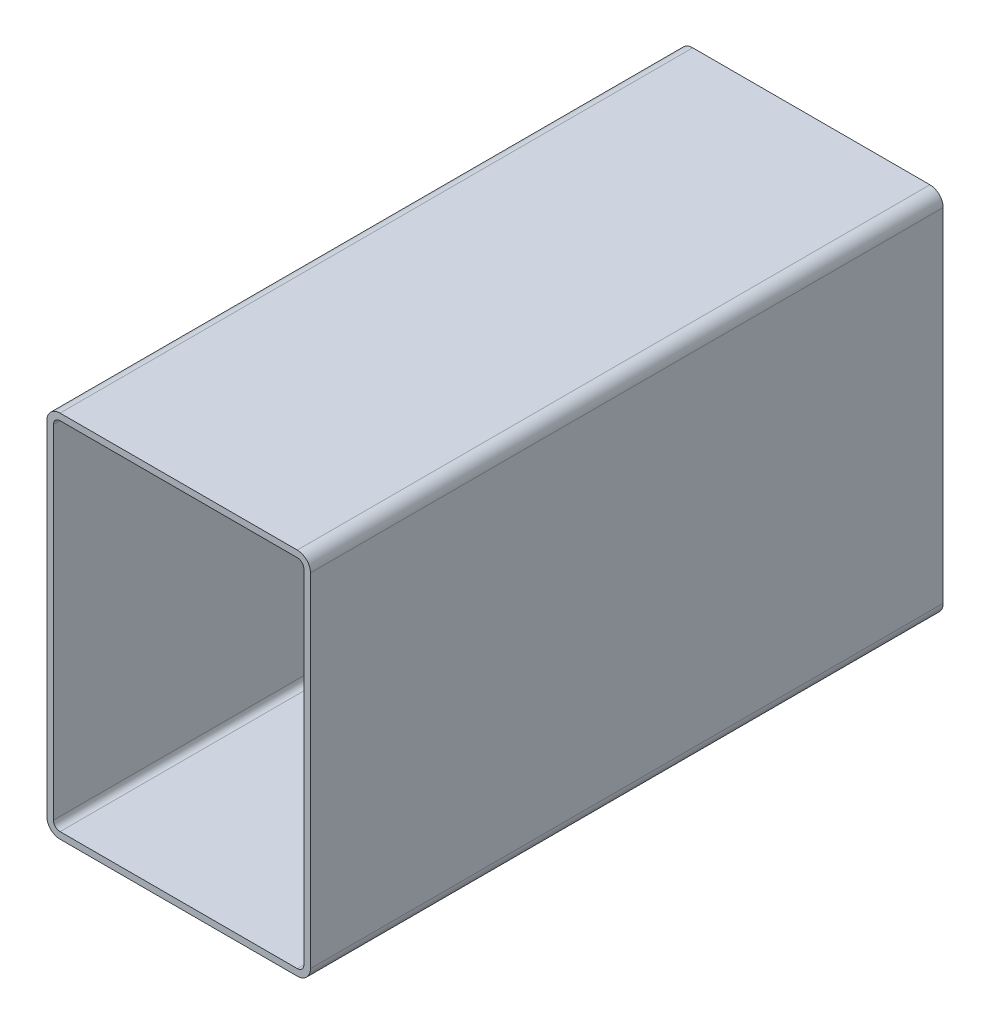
ISO-10303-21;
HEADER;
FILE_DESCRIPTION(('STEP AP214'),'2;1');
FILE_NAME('part.step','',(''),(''),'','','');
FILE_SCHEMA(('AUTOMOTIVE_DESIGN { 1 0 10303 214 1 1 1 1 }'));
ENDSEC;
DATA;
#1=APPLICATION_CONTEXT('core data for automotive mechanical design processes');
#2=APPLICATION_PROTOCOL_DEFINITION('international standard','automotive_design',2000,#1);
#3=PRODUCT_CONTEXT('',#1,'mechanical');
#4=PRODUCT('Part','Part','',(#3));
#5=PRODUCT_RELATED_PRODUCT_CATEGORY('part','',(#4));
#6=PRODUCT_DEFINITION_FORMATION('','',#4);
#7=PRODUCT_DEFINITION_CONTEXT('part definition',#1,'design');
#8=PRODUCT_DEFINITION('design','',#6,#7);
#9=PRODUCT_DEFINITION_SHAPE('','',#8);
#10=(LENGTH_UNIT() NAMED_UNIT(*) SI_UNIT(.MILLI.,.METRE.));
#11=(NAMED_UNIT(*) PLANE_ANGLE_UNIT() SI_UNIT($,.RADIAN.));
#12=(NAMED_UNIT(*) SI_UNIT($,.STERADIAN.) SOLID_ANGLE_UNIT());
#13=UNCERTAINTY_MEASURE_WITH_UNIT(LENGTH_MEASURE(1.E-05),#10,'distance_accuracy_value','');
#14=(GEOMETRIC_REPRESENTATION_CONTEXT(3) GLOBAL_UNCERTAINTY_ASSIGNED_CONTEXT((#13)) GLOBAL_UNIT_ASSIGNED_CONTEXT((#10,
#11,#12)) REPRESENTATION_CONTEXT('',''));
#15=CARTESIAN_POINT('',(0.,0.,0.));
#16=DIRECTION('',(0.,0.,1.));
#17=DIRECTION('',(1.,0.,0.));
#18=AXIS2_PLACEMENT_3D('',#15,#16,#17);
#19=CARTESIAN_POINT('',(7.2112396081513,173.439039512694,304.8));
#20=DIRECTION('',(0.,0.,1.));
#21=DIRECTION('',(1.,0.,0.));
#22=AXIS2_PLACEMENT_3D('',#19,#20,#21);
#23=PLANE('',#22);
#24=CARTESIAN_POINT('',(7.2112396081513,173.439039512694,304.8));
#25=DIRECTION('',(0.,0.,1.));
#26=DIRECTION('',(1.,0.,0.));
#27=AXIS2_PLACEMENT_3D('',#24,#25,#26);
#28=CIRCLE('',#27,6.35);
#29=CARTESIAN_POINT('',(7.2112396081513,179.789039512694,304.8));
#30=VERTEX_POINT('',#29);
#31=CARTESIAN_POINT('',(0.8612396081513,173.439039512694,304.8));
#32=VERTEX_POINT('',#31);
#33=EDGE_CURVE('E211',#30,#32,#28,.T.);
#34=ORIENTED_EDGE('',*,*,#33,.T.);
#35=DIRECTION('',(0.,-1.,0.));
#36=VECTOR('',#35,1.);
#37=CARTESIAN_POINT('',(0.8612396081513,8.33903951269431,304.8));
#38=LINE('',#37,#36);
#39=CARTESIAN_POINT('',(0.8612396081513,8.33903951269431,304.8));
#40=VERTEX_POINT('',#39);
#41=EDGE_CURVE('E214',#32,#40,#38,.T.);
#42=ORIENTED_EDGE('',*,*,#41,.T.);
#43=CARTESIAN_POINT('',(7.2112396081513,8.33903951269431,304.8));
#44=DIRECTION('',(0.,0.,1.));
#45=DIRECTION('',(1.,0.,0.));
#46=AXIS2_PLACEMENT_3D('',#43,#44,#45);
#47=CIRCLE('',#46,6.35);
#48=CARTESIAN_POINT('',(7.2112396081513,1.98903951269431,304.8));
#49=VERTEX_POINT('',#48);
#50=EDGE_CURVE('E217',#40,#49,#47,.T.);
#51=ORIENTED_EDGE('',*,*,#50,.T.);
#52=DIRECTION('',(1.,0.,0.));
#53=VECTOR('',#52,1.);
#54=CARTESIAN_POINT('',(121.511239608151,1.98903951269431,304.8));
#55=LINE('',#54,#53);
#56=CARTESIAN_POINT('',(121.511239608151,1.98903951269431,304.8));
#57=VERTEX_POINT('',#56);
#58=EDGE_CURVE('E219',#49,#57,#55,.T.);
#59=ORIENTED_EDGE('',*,*,#58,.T.);
#60=CARTESIAN_POINT('',(121.511239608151,8.33903951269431,304.8));
#61=DIRECTION('',(0.,0.,1.));
#62=DIRECTION('',(1.,0.,0.));
#63=AXIS2_PLACEMENT_3D('',#60,#61,#62);
#64=CIRCLE('',#63,6.35);
#65=CARTESIAN_POINT('',(127.861239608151,8.33903951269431,304.8));
#66=VERTEX_POINT('',#65);
#67=EDGE_CURVE('E221',#57,#66,#64,.T.);
#68=ORIENTED_EDGE('',*,*,#67,.T.);
#69=DIRECTION('',(0.,1.,0.));
#70=VECTOR('',#69,1.);
#71=CARTESIAN_POINT('',(127.861239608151,173.439039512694,304.8));
#72=LINE('',#71,#70);
#73=CARTESIAN_POINT('',(127.861239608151,173.439039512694,304.8));
#74=VERTEX_POINT('',#73);
#75=EDGE_CURVE('E223',#66,#74,#72,.T.);
#76=ORIENTED_EDGE('',*,*,#75,.T.);
#77=CARTESIAN_POINT('',(121.511239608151,173.439039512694,304.8));
#78=DIRECTION('',(0.,0.,1.));
#79=DIRECTION('',(1.,0.,0.));
#80=AXIS2_PLACEMENT_3D('',#77,#78,#79);
#81=CIRCLE('',#80,6.34999999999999);
#82=CARTESIAN_POINT('',(121.511239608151,179.789039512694,304.8));
#83=VERTEX_POINT('',#82);
#84=EDGE_CURVE('E225',#74,#83,#81,.T.);
#85=ORIENTED_EDGE('',*,*,#84,.T.);
#86=DIRECTION('',(-1.,0.,0.));
#87=VECTOR('',#86,1.);
#88=CARTESIAN_POINT('',(7.2112396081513,179.789039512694,304.8));
#89=LINE('',#88,#87);
#90=EDGE_CURVE('E227',#83,#30,#89,.T.);
#91=ORIENTED_EDGE('',*,*,#90,.T.);
#92=EDGE_LOOP('',(#34,#42,#51,#59,#68,#76,#85,#91));
#93=FACE_BOUND('',#92,.T.);
#94=DIRECTION('',(0.,-1.,0.));
#95=VECTOR('',#94,1.);
#96=CARTESIAN_POINT('',(4.0362396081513,8.33903951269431,304.8));
#97=LINE('',#96,#95);
#98=CARTESIAN_POINT('',(4.0362396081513,173.439039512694,304.8));
#99=VERTEX_POINT('',#98);
#100=CARTESIAN_POINT('',(4.0362396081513,8.33903951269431,304.8));
#101=VERTEX_POINT('',#100);
#102=EDGE_CURVE('E154',#99,#101,#97,.T.);
#103=ORIENTED_EDGE('',*,*,#102,.F.);
#104=CARTESIAN_POINT('',(7.2112396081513,173.439039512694,304.8));
#105=DIRECTION('',(0.,0.,1.));
#106=DIRECTION('',(1.,0.,0.));
#107=AXIS2_PLACEMENT_3D('',#104,#105,#106);
#108=CIRCLE('',#107,3.17500000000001);
#109=CARTESIAN_POINT('',(7.2112396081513,176.614039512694,304.8));
#110=VERTEX_POINT('',#109);
#111=EDGE_CURVE('E146',#110,#99,#108,.T.);
#112=ORIENTED_EDGE('',*,*,#111,.F.);
#113=DIRECTION('',(-1.,0.,0.));
#114=VECTOR('',#113,1.);
#115=CARTESIAN_POINT('',(7.2112396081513,176.614039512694,304.8));
#116=LINE('',#115,#114);
#117=CARTESIAN_POINT('',(121.511239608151,176.614039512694,304.8));
#118=VERTEX_POINT('',#117);
#119=EDGE_CURVE('E179',#118,#110,#116,.T.);
#120=ORIENTED_EDGE('',*,*,#119,.F.);
#121=CARTESIAN_POINT('',(121.511239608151,173.439039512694,304.8));
#122=DIRECTION('',(0.,0.,1.));
#123=DIRECTION('',(1.,0.,0.));
#124=AXIS2_PLACEMENT_3D('',#121,#122,#123);
#125=CIRCLE('',#124,3.175);
#126=CARTESIAN_POINT('',(124.686239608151,173.439039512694,304.8));
#127=VERTEX_POINT('',#126);
#128=EDGE_CURVE('E177',#127,#118,#125,.T.);
#129=ORIENTED_EDGE('',*,*,#128,.F.);
#130=DIRECTION('',(0.,1.,0.));
#131=VECTOR('',#130,1.);
#132=CARTESIAN_POINT('',(124.686239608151,173.439039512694,304.8));
#133=LINE('',#132,#131);
#134=CARTESIAN_POINT('',(124.686239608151,8.33903951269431,304.8));
#135=VERTEX_POINT('',#134);
#136=EDGE_CURVE('E175',#135,#127,#133,.T.);
#137=ORIENTED_EDGE('',*,*,#136,.F.);
#138=CARTESIAN_POINT('',(121.511239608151,8.33903951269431,304.8));
#139=DIRECTION('',(0.,0.,1.));
#140=DIRECTION('',(1.,0.,0.));
#141=AXIS2_PLACEMENT_3D('',#138,#139,#140);
#142=CIRCLE('',#141,3.175);
#143=CARTESIAN_POINT('',(121.511239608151,5.16403951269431,304.8));
#144=VERTEX_POINT('',#143);
#145=EDGE_CURVE('E173',#144,#135,#142,.T.);
#146=ORIENTED_EDGE('',*,*,#145,.F.);
#147=DIRECTION('',(1.,0.,0.));
#148=VECTOR('',#147,1.);
#149=CARTESIAN_POINT('',(121.511239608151,5.16403951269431,304.8));
#150=LINE('',#149,#148);
#151=CARTESIAN_POINT('',(7.2112396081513,5.16403951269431,304.8));
#152=VERTEX_POINT('',#151);
#153=EDGE_CURVE('E169',#152,#144,#150,.T.);
#154=ORIENTED_EDGE('',*,*,#153,.F.);
#155=CARTESIAN_POINT('',(7.2112396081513,8.33903951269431,304.8));
#156=DIRECTION('',(0.,0.,1.));
#157=DIRECTION('',(1.,0.,0.));
#158=AXIS2_PLACEMENT_3D('',#155,#156,#157);
#159=CIRCLE('',#158,3.175);
#160=EDGE_CURVE('E167',#101,#152,#159,.T.);
#161=ORIENTED_EDGE('',*,*,#160,.F.);
#162=EDGE_LOOP('',(#103,#112,#120,#129,#137,#146,#154,#161));
#163=FACE_BOUND('',#162,.T.);
#164=ADVANCED_FACE('F33',(#93,#163),#23,.T.);
#165=CARTESIAN_POINT('',(7.2112396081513,173.439039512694,0.));
#166=DIRECTION('',(0.,0.,1.));
#167=DIRECTION('',(1.,0.,0.));
#168=AXIS2_PLACEMENT_3D('',#165,#166,#167);
#169=PLANE('',#168);
#170=CARTESIAN_POINT('',(7.2112396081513,173.439039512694,0.));
#171=DIRECTION('',(0.,0.,1.));
#172=DIRECTION('',(1.,0.,0.));
#173=AXIS2_PLACEMENT_3D('',#170,#171,#172);
#174=CIRCLE('',#173,6.35);
#175=CARTESIAN_POINT('',(7.2112396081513,179.789039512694,0.));
#176=VERTEX_POINT('',#175);
#177=CARTESIAN_POINT('',(0.8612396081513,173.439039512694,0.));
#178=VERTEX_POINT('',#177);
#179=EDGE_CURVE('E162',#176,#178,#174,.T.);
#180=ORIENTED_EDGE('',*,*,#179,.F.);
#181=DIRECTION('',(-1.,0.,0.));
#182=VECTOR('',#181,1.);
#183=CARTESIAN_POINT('',(7.2112396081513,179.789039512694,0.));
#184=LINE('',#183,#182);
#185=CARTESIAN_POINT('',(121.511239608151,179.789039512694,0.));
#186=VERTEX_POINT('',#185);
#187=EDGE_CURVE('E215',#186,#176,#184,.T.);
#188=ORIENTED_EDGE('',*,*,#187,.F.);
#189=CARTESIAN_POINT('',(121.511239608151,173.439039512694,0.));
#190=DIRECTION('',(0.,0.,1.));
#191=DIRECTION('',(1.,0.,0.));
#192=AXIS2_PLACEMENT_3D('',#189,#190,#191);
#193=CIRCLE('',#192,6.34999999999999);
#194=CARTESIAN_POINT('',(127.861239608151,173.439039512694,0.));
#195=VERTEX_POINT('',#194);
#196=EDGE_CURVE('E242',#195,#186,#193,.T.);
#197=ORIENTED_EDGE('',*,*,#196,.F.);
#198=DIRECTION('',(0.,1.,0.));
#199=VECTOR('',#198,1.);
#200=CARTESIAN_POINT('',(127.861239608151,173.439039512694,0.));
#201=LINE('',#200,#199);
#202=CARTESIAN_POINT('',(127.861239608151,8.33903951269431,0.));
#203=VERTEX_POINT('',#202);
#204=EDGE_CURVE('E240',#203,#195,#201,.T.);
#205=ORIENTED_EDGE('',*,*,#204,.F.);
#206=CARTESIAN_POINT('',(121.511239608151,8.33903951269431,0.));
#207=DIRECTION('',(0.,0.,1.));
#208=DIRECTION('',(1.,0.,0.));
#209=AXIS2_PLACEMENT_3D('',#206,#207,#208);
#210=CIRCLE('',#209,6.35);
#211=CARTESIAN_POINT('',(121.511239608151,1.98903951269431,0.));
#212=VERTEX_POINT('',#211);
#213=EDGE_CURVE('E238',#212,#203,#210,.T.);
#214=ORIENTED_EDGE('',*,*,#213,.F.);
#215=DIRECTION('',(1.,0.,0.));
#216=VECTOR('',#215,1.);
#217=CARTESIAN_POINT('',(121.511239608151,1.98903951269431,0.));
#218=LINE('',#217,#216);
#219=CARTESIAN_POINT('',(7.2112396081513,1.98903951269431,0.));
#220=VERTEX_POINT('',#219);
#221=EDGE_CURVE('E236',#220,#212,#218,.T.);
#222=ORIENTED_EDGE('',*,*,#221,.F.);
#223=CARTESIAN_POINT('',(7.2112396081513,8.33903951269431,0.));
#224=DIRECTION('',(0.,0.,1.));
#225=DIRECTION('',(1.,0.,0.));
#226=AXIS2_PLACEMENT_3D('',#223,#224,#225);
#227=CIRCLE('',#226,6.35);
#228=CARTESIAN_POINT('',(0.8612396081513,8.33903951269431,0.));
#229=VERTEX_POINT('',#228);
#230=EDGE_CURVE('E234',#229,#220,#227,.T.);
#231=ORIENTED_EDGE('',*,*,#230,.F.);
#232=DIRECTION('',(0.,-1.,0.));
#233=VECTOR('',#232,1.);
#234=CARTESIAN_POINT('',(0.8612396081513,8.33903951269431,0.));
#235=LINE('',#234,#233);
#236=EDGE_CURVE('E232',#178,#229,#235,.T.);
#237=ORIENTED_EDGE('',*,*,#236,.F.);
#238=EDGE_LOOP('',(#180,#188,#197,#205,#214,#222,#231,#237));
#239=FACE_BOUND('',#238,.T.);
#240=CARTESIAN_POINT('',(7.2112396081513,173.439039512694,0.));
#241=DIRECTION('',(0.,0.,1.));
#242=DIRECTION('',(1.,0.,0.));
#243=AXIS2_PLACEMENT_3D('',#240,#241,#242);
#244=CIRCLE('',#243,3.17500000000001);
#245=CARTESIAN_POINT('',(7.2112396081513,176.614039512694,0.));
#246=VERTEX_POINT('',#245);
#247=CARTESIAN_POINT('',(4.0362396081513,173.439039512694,0.));
#248=VERTEX_POINT('',#247);
#249=EDGE_CURVE('E56',#246,#248,#244,.T.);
#250=ORIENTED_EDGE('',*,*,#249,.T.);
#251=DIRECTION('',(0.,-1.,0.));
#252=VECTOR('',#251,1.);
#253=CARTESIAN_POINT('',(4.0362396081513,8.33903951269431,0.));
#254=LINE('',#253,#252);
#255=CARTESIAN_POINT('',(4.0362396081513,8.33903951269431,0.));
#256=VERTEX_POINT('',#255);
#257=EDGE_CURVE('E161',#248,#256,#254,.T.);
#258=ORIENTED_EDGE('',*,*,#257,.T.);
#259=CARTESIAN_POINT('',(7.2112396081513,8.33903951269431,0.));
#260=DIRECTION('',(0.,0.,1.));
#261=DIRECTION('',(1.,0.,0.));
#262=AXIS2_PLACEMENT_3D('',#259,#260,#261);
#263=CIRCLE('',#262,3.175);
#264=CARTESIAN_POINT('',(7.2112396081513,5.16403951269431,0.));
#265=VERTEX_POINT('',#264);
#266=EDGE_CURVE('E183',#256,#265,#263,.T.);
#267=ORIENTED_EDGE('',*,*,#266,.T.);
#268=DIRECTION('',(1.,0.,0.));
#269=VECTOR('',#268,1.);
#270=CARTESIAN_POINT('',(121.511239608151,5.16403951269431,0.));
#271=LINE('',#270,#269);
#272=CARTESIAN_POINT('',(121.511239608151,5.16403951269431,0.));
#273=VERTEX_POINT('',#272);
#274=EDGE_CURVE('E186',#265,#273,#271,.T.);
#275=ORIENTED_EDGE('',*,*,#274,.T.);
#276=CARTESIAN_POINT('',(121.511239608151,8.33903951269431,0.));
#277=DIRECTION('',(0.,0.,1.));
#278=DIRECTION('',(1.,0.,0.));
#279=AXIS2_PLACEMENT_3D('',#276,#277,#278);
#280=CIRCLE('',#279,3.175);
#281=CARTESIAN_POINT('',(124.686239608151,8.33903951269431,0.));
#282=VERTEX_POINT('',#281);
#283=EDGE_CURVE('E189',#273,#282,#280,.T.);
#284=ORIENTED_EDGE('',*,*,#283,.T.);
#285=DIRECTION('',(0.,1.,0.));
#286=VECTOR('',#285,1.);
#287=CARTESIAN_POINT('',(124.686239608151,173.439039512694,0.));
#288=LINE('',#287,#286);
#289=CARTESIAN_POINT('',(124.686239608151,173.439039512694,0.));
#290=VERTEX_POINT('',#289);
#291=EDGE_CURVE('E192',#282,#290,#288,.T.);
#292=ORIENTED_EDGE('',*,*,#291,.T.);
#293=CARTESIAN_POINT('',(121.511239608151,173.439039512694,0.));
#294=DIRECTION('',(0.,0.,1.));
#295=DIRECTION('',(1.,0.,0.));
#296=AXIS2_PLACEMENT_3D('',#293,#294,#295);
#297=CIRCLE('',#296,3.175);
#298=CARTESIAN_POINT('',(121.511239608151,176.614039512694,0.));
#299=VERTEX_POINT('',#298);
#300=EDGE_CURVE('E195',#290,#299,#297,.T.);
#301=ORIENTED_EDGE('',*,*,#300,.T.);
#302=DIRECTION('',(-1.,0.,0.));
#303=VECTOR('',#302,1.);
#304=CARTESIAN_POINT('',(7.2112396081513,176.614039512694,0.));
#305=LINE('',#304,#303);
#306=EDGE_CURVE('E155',#299,#246,#305,.T.);
#307=ORIENTED_EDGE('',*,*,#306,.T.);
#308=EDGE_LOOP('',(#250,#258,#267,#275,#284,#292,#301,#307));
#309=FACE_BOUND('',#308,.T.);
#310=ADVANCED_FACE('F272',(#239,#309),#169,.F.);
#311=CARTESIAN_POINT('',(7.2112396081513,173.439039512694,304.8));
#312=DIRECTION('',(0.,0.,-1.));
#313=DIRECTION('',(-1.,0.,0.));
#314=AXIS2_PLACEMENT_3D('',#311,#312,#313);
#315=CYLINDRICAL_SURFACE('',#314,6.35);
#316=ORIENTED_EDGE('',*,*,#179,.T.);
#317=DIRECTION('',(0.,0.,-1.));
#318=VECTOR('',#317,1.);
#319=CARTESIAN_POINT('',(0.8612396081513,173.439039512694,304.8));
#320=LINE('',#319,#318);
#321=EDGE_CURVE('E11',#32,#178,#320,.T.);
#322=ORIENTED_EDGE('',*,*,#321,.F.);
#323=ORIENTED_EDGE('',*,*,#33,.F.);
#324=DIRECTION('',(0.,0.,-1.));
#325=VECTOR('',#324,1.);
#326=CARTESIAN_POINT('',(7.2112396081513,179.789039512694,304.8));
#327=LINE('',#326,#325);
#328=EDGE_CURVE('E229',#30,#176,#327,.T.);
#329=ORIENTED_EDGE('',*,*,#328,.T.);
#330=EDGE_LOOP('',(#316,#322,#323,#329));
#331=FACE_BOUND('',#330,.T.);
#332=ADVANCED_FACE('F35',(#331),#315,.T.);
#333=CARTESIAN_POINT('',(0.8612396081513,8.33903951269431,304.8));
#334=DIRECTION('',(1.,0.,0.));
#335=DIRECTION('',(0.,0.,-1.));
#336=AXIS2_PLACEMENT_3D('',#333,#334,#335);
#337=PLANE('',#336);
#338=ORIENTED_EDGE('',*,*,#236,.T.);
#339=DIRECTION('',(0.,0.,-1.));
#340=VECTOR('',#339,1.);
#341=CARTESIAN_POINT('',(0.8612396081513,8.33903951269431,304.8));
#342=LINE('',#341,#340);
#343=EDGE_CURVE('E41',#40,#229,#342,.T.);
#344=ORIENTED_EDGE('',*,*,#343,.F.);
#345=ORIENTED_EDGE('',*,*,#41,.F.);
#346=ORIENTED_EDGE('',*,*,#321,.T.);
#347=EDGE_LOOP('',(#338,#344,#345,#346));
#348=FACE_BOUND('',#347,.T.);
#349=ADVANCED_FACE('F289',(#348),#337,.F.);
#350=CARTESIAN_POINT('',(7.2112396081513,8.33903951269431,304.8));
#351=DIRECTION('',(0.,0.,-1.));
#352=DIRECTION('',(-1.,0.,0.));
#353=AXIS2_PLACEMENT_3D('',#350,#351,#352);
#354=CYLINDRICAL_SURFACE('',#353,6.35);
#355=ORIENTED_EDGE('',*,*,#230,.T.);
#356=DIRECTION('',(0.,0.,-1.));
#357=VECTOR('',#356,1.);
#358=CARTESIAN_POINT('',(7.2112396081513,1.98903951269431,304.8));
#359=LINE('',#358,#357);
#360=EDGE_CURVE('E259',#49,#220,#359,.T.);
#361=ORIENTED_EDGE('',*,*,#360,.F.);
#362=ORIENTED_EDGE('',*,*,#50,.F.);
#363=ORIENTED_EDGE('',*,*,#343,.T.);
#364=EDGE_LOOP('',(#355,#361,#362,#363));
#365=FACE_BOUND('',#364,.T.);
#366=ADVANCED_FACE('F266',(#365),#354,.T.);
#367=CARTESIAN_POINT('',(121.511239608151,1.98903951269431,304.8));
#368=DIRECTION('',(0.,1.,0.));
#369=DIRECTION('',(0.,0.,1.));
#370=AXIS2_PLACEMENT_3D('',#367,#368,#369);
#371=PLANE('',#370);
#372=ORIENTED_EDGE('',*,*,#221,.T.);
#373=DIRECTION('',(0.,0.,-1.));
#374=VECTOR('',#373,1.);
#375=CARTESIAN_POINT('',(121.511239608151,1.98903951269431,304.8));
#376=LINE('',#375,#374);
#377=EDGE_CURVE('E256',#57,#212,#376,.T.);
#378=ORIENTED_EDGE('',*,*,#377,.F.);
#379=ORIENTED_EDGE('',*,*,#58,.F.);
#380=ORIENTED_EDGE('',*,*,#360,.T.);
#381=EDGE_LOOP('',(#372,#378,#379,#380));
#382=FACE_BOUND('',#381,.T.);
#383=ADVANCED_FACE('F278',(#382),#371,.F.);
#384=CARTESIAN_POINT('',(121.511239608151,8.33903951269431,304.8));
#385=DIRECTION('',(0.,0.,-1.));
#386=DIRECTION('',(-1.,0.,0.));
#387=AXIS2_PLACEMENT_3D('',#384,#385,#386);
#388=CYLINDRICAL_SURFACE('',#387,6.35);
#389=ORIENTED_EDGE('',*,*,#213,.T.);
#390=DIRECTION('',(0.,0.,-1.));
#391=VECTOR('',#390,1.);
#392=CARTESIAN_POINT('',(127.861239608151,8.33903951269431,304.8));
#393=LINE('',#392,#391);
#394=EDGE_CURVE('E253',#66,#203,#393,.T.);
#395=ORIENTED_EDGE('',*,*,#394,.F.);
#396=ORIENTED_EDGE('',*,*,#67,.F.);
#397=ORIENTED_EDGE('',*,*,#377,.T.);
#398=EDGE_LOOP('',(#389,#395,#396,#397));
#399=FACE_BOUND('',#398,.T.);
#400=ADVANCED_FACE('F282',(#399),#388,.T.);
#401=CARTESIAN_POINT('',(127.861239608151,173.439039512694,304.8));
#402=DIRECTION('',(-1.,0.,0.));
#403=DIRECTION('',(0.,0.,1.));
#404=AXIS2_PLACEMENT_3D('',#401,#402,#403);
#405=PLANE('',#404);
#406=ORIENTED_EDGE('',*,*,#204,.T.);
#407=DIRECTION('',(0.,0.,-1.));
#408=VECTOR('',#407,1.);
#409=CARTESIAN_POINT('',(127.861239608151,173.439039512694,304.8));
#410=LINE('',#409,#408);
#411=EDGE_CURVE('E250',#74,#195,#410,.T.);
#412=ORIENTED_EDGE('',*,*,#411,.F.);
#413=ORIENTED_EDGE('',*,*,#75,.F.);
#414=ORIENTED_EDGE('',*,*,#394,.T.);
#415=EDGE_LOOP('',(#406,#412,#413,#414));
#416=FACE_BOUND('',#415,.T.);
#417=ADVANCED_FACE('F302',(#416),#405,.F.);
#418=CARTESIAN_POINT('',(121.511239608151,173.439039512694,304.8));
#419=DIRECTION('',(0.,0.,-1.));
#420=DIRECTION('',(-1.,0.,0.));
#421=AXIS2_PLACEMENT_3D('',#418,#419,#420);
#422=CYLINDRICAL_SURFACE('',#421,6.34999999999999);
#423=ORIENTED_EDGE('',*,*,#196,.T.);
#424=DIRECTION('',(0.,0.,-1.));
#425=VECTOR('',#424,1.);
#426=CARTESIAN_POINT('',(121.511239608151,179.789039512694,304.8));
#427=LINE('',#426,#425);
#428=EDGE_CURVE('E247',#83,#186,#427,.T.);
#429=ORIENTED_EDGE('',*,*,#428,.F.);
#430=ORIENTED_EDGE('',*,*,#84,.F.);
#431=ORIENTED_EDGE('',*,*,#411,.T.);
#432=EDGE_LOOP('',(#423,#429,#430,#431));
#433=FACE_BOUND('',#432,.T.);
#434=ADVANCED_FACE('F300',(#433),#422,.T.);
#435=CARTESIAN_POINT('',(7.2112396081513,179.789039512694,304.8));
#436=DIRECTION('',(0.,-1.,0.));
#437=DIRECTION('',(0.,0.,-1.));
#438=AXIS2_PLACEMENT_3D('',#435,#436,#437);
#439=PLANE('',#438);
#440=ORIENTED_EDGE('',*,*,#187,.T.);
#441=ORIENTED_EDGE('',*,*,#328,.F.);
#442=ORIENTED_EDGE('',*,*,#90,.F.);
#443=ORIENTED_EDGE('',*,*,#428,.T.);
#444=EDGE_LOOP('',(#440,#441,#442,#443));
#445=FACE_BOUND('',#444,.T.);
#446=ADVANCED_FACE('F295',(#445),#439,.F.);
#447=CARTESIAN_POINT('',(7.2112396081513,173.439039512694,304.8));
#448=DIRECTION('',(0.,0.,-1.));
#449=DIRECTION('',(-1.,0.,0.));
#450=AXIS2_PLACEMENT_3D('',#447,#448,#449);
#451=CYLINDRICAL_SURFACE('',#450,3.17500000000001);
#452=ORIENTED_EDGE('',*,*,#249,.F.);
#453=DIRECTION('',(0.,0.,-1.));
#454=VECTOR('',#453,1.);
#455=CARTESIAN_POINT('',(7.2112396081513,176.614039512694,304.8));
#456=LINE('',#455,#454);
#457=EDGE_CURVE('E150',#110,#246,#456,.T.);
#458=ORIENTED_EDGE('',*,*,#457,.F.);
#459=ORIENTED_EDGE('',*,*,#111,.T.);
#460=DIRECTION('',(0.,0.,-1.));
#461=VECTOR('',#460,1.);
#462=CARTESIAN_POINT('',(4.0362396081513,173.439039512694,304.8));
#463=LINE('',#462,#461);
#464=EDGE_CURVE('E149',#99,#248,#463,.T.);
#465=ORIENTED_EDGE('',*,*,#464,.T.);
#466=EDGE_LOOP('',(#452,#458,#459,#465));
#467=FACE_BOUND('',#466,.T.);
#468=ADVANCED_FACE('F148',(#467),#451,.F.);
#469=CARTESIAN_POINT('',(4.0362396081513,8.33903951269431,304.8));
#470=DIRECTION('',(1.,0.,0.));
#471=DIRECTION('',(0.,0.,-1.));
#472=AXIS2_PLACEMENT_3D('',#469,#470,#471);
#473=PLANE('',#472);
#474=ORIENTED_EDGE('',*,*,#257,.F.);
#475=ORIENTED_EDGE('',*,*,#464,.F.);
#476=ORIENTED_EDGE('',*,*,#102,.T.);
#477=DIRECTION('',(0.,0.,-1.));
#478=VECTOR('',#477,1.);
#479=CARTESIAN_POINT('',(4.0362396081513,8.33903951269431,304.8));
#480=LINE('',#479,#478);
#481=EDGE_CURVE('E163',#101,#256,#480,.T.);
#482=ORIENTED_EDGE('',*,*,#481,.T.);
#483=EDGE_LOOP('',(#474,#475,#476,#482));
#484=FACE_BOUND('',#483,.T.);
#485=ADVANCED_FACE('F158',(#484),#473,.T.);
#486=CARTESIAN_POINT('',(7.2112396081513,8.33903951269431,304.8));
#487=DIRECTION('',(0.,0.,-1.));
#488=DIRECTION('',(-1.,0.,0.));
#489=AXIS2_PLACEMENT_3D('',#486,#487,#488);
#490=CYLINDRICAL_SURFACE('',#489,3.175);
#491=ORIENTED_EDGE('',*,*,#266,.F.);
#492=ORIENTED_EDGE('',*,*,#481,.F.);
#493=ORIENTED_EDGE('',*,*,#160,.T.);
#494=DIRECTION('',(0.,0.,-1.));
#495=VECTOR('',#494,1.);
#496=CARTESIAN_POINT('',(7.2112396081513,5.16403951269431,304.8));
#497=LINE('',#496,#495);
#498=EDGE_CURVE('E208',#152,#265,#497,.T.);
#499=ORIENTED_EDGE('',*,*,#498,.T.);
#500=EDGE_LOOP('',(#491,#492,#493,#499));
#501=FACE_BOUND('',#500,.T.);
#502=ADVANCED_FACE('F327',(#501),#490,.F.);
#503=CARTESIAN_POINT('',(121.511239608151,5.16403951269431,304.8));
#504=DIRECTION('',(0.,1.,0.));
#505=DIRECTION('',(0.,0.,1.));
#506=AXIS2_PLACEMENT_3D('',#503,#504,#505);
#507=PLANE('',#506);
#508=ORIENTED_EDGE('',*,*,#274,.F.);
#509=ORIENTED_EDGE('',*,*,#498,.F.);
#510=ORIENTED_EDGE('',*,*,#153,.T.);
#511=DIRECTION('',(0.,0.,-1.));
#512=VECTOR('',#511,1.);
#513=CARTESIAN_POINT('',(121.511239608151,5.16403951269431,304.8));
#514=LINE('',#513,#512);
#515=EDGE_CURVE('E206',#144,#273,#514,.T.);
#516=ORIENTED_EDGE('',*,*,#515,.T.);
#517=EDGE_LOOP('',(#508,#509,#510,#516));
#518=FACE_BOUND('',#517,.T.);
#519=ADVANCED_FACE('F331',(#518),#507,.T.);
#520=CARTESIAN_POINT('',(121.511239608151,8.33903951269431,304.8));
#521=DIRECTION('',(0.,0.,-1.));
#522=DIRECTION('',(-1.,0.,0.));
#523=AXIS2_PLACEMENT_3D('',#520,#521,#522);
#524=CYLINDRICAL_SURFACE('',#523,3.175);
#525=ORIENTED_EDGE('',*,*,#283,.F.);
#526=ORIENTED_EDGE('',*,*,#515,.F.);
#527=ORIENTED_EDGE('',*,*,#145,.T.);
#528=DIRECTION('',(0.,0.,-1.));
#529=VECTOR('',#528,1.);
#530=CARTESIAN_POINT('',(124.686239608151,8.33903951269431,304.8));
#531=LINE('',#530,#529);
#532=EDGE_CURVE('E204',#135,#282,#531,.T.);
#533=ORIENTED_EDGE('',*,*,#532,.T.);
#534=EDGE_LOOP('',(#525,#526,#527,#533));
#535=FACE_BOUND('',#534,.T.);
#536=ADVANCED_FACE('F337',(#535),#524,.F.);
#537=CARTESIAN_POINT('',(124.686239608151,173.439039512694,304.8));
#538=DIRECTION('',(-1.,0.,0.));
#539=DIRECTION('',(0.,0.,1.));
#540=AXIS2_PLACEMENT_3D('',#537,#538,#539);
#541=PLANE('',#540);
#542=ORIENTED_EDGE('',*,*,#291,.F.);
#543=ORIENTED_EDGE('',*,*,#532,.F.);
#544=ORIENTED_EDGE('',*,*,#136,.T.);
#545=DIRECTION('',(0.,0.,-1.));
#546=VECTOR('',#545,1.);
#547=CARTESIAN_POINT('',(124.686239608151,173.439039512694,304.8));
#548=LINE('',#547,#546);
#549=EDGE_CURVE('E202',#127,#290,#548,.T.);
#550=ORIENTED_EDGE('',*,*,#549,.T.);
#551=EDGE_LOOP('',(#542,#543,#544,#550));
#552=FACE_BOUND('',#551,.T.);
#553=ADVANCED_FACE('F341',(#552),#541,.T.);
#554=CARTESIAN_POINT('',(121.511239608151,173.439039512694,304.8));
#555=DIRECTION('',(0.,0.,-1.));
#556=DIRECTION('',(-1.,0.,0.));
#557=AXIS2_PLACEMENT_3D('',#554,#555,#556);
#558=CYLINDRICAL_SURFACE('',#557,3.175);
#559=ORIENTED_EDGE('',*,*,#300,.F.);
#560=ORIENTED_EDGE('',*,*,#549,.F.);
#561=ORIENTED_EDGE('',*,*,#128,.T.);
#562=DIRECTION('',(0.,0.,-1.));
#563=VECTOR('',#562,1.);
#564=CARTESIAN_POINT('',(121.511239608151,176.614039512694,304.8));
#565=LINE('',#564,#563);
#566=EDGE_CURVE('E48',#118,#299,#565,.T.);
#567=ORIENTED_EDGE('',*,*,#566,.T.);
#568=EDGE_LOOP('',(#559,#560,#561,#567));
#569=FACE_BOUND('',#568,.T.);
#570=ADVANCED_FACE('F345',(#569),#558,.F.);
#571=CARTESIAN_POINT('',(7.2112396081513,176.614039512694,304.8));
#572=DIRECTION('',(0.,-1.,0.));
#573=DIRECTION('',(0.,0.,-1.));
#574=AXIS2_PLACEMENT_3D('',#571,#572,#573);
#575=PLANE('',#574);
#576=ORIENTED_EDGE('',*,*,#306,.F.);
#577=ORIENTED_EDGE('',*,*,#566,.F.);
#578=ORIENTED_EDGE('',*,*,#119,.T.);
#579=ORIENTED_EDGE('',*,*,#457,.T.);
#580=EDGE_LOOP('',(#576,#577,#578,#579));
#581=FACE_BOUND('',#580,.T.);
#582=ADVANCED_FACE('F349',(#581),#575,.T.);
#583=CLOSED_SHELL('',(#164,#310,#332,#349,#366,#383,#400,#417,#434,#446,#468,#485,#502,#519,
#536,#553,#570,#582));
#584=MANIFOLD_SOLID_BREP('B2',#583);
#585=ADVANCED_BREP_SHAPE_REPRESENTATION('',(#18,#584),#14);
#586=SHAPE_DEFINITION_REPRESENTATION(#9,#585);
ENDSEC;
END-ISO-10303-21;
